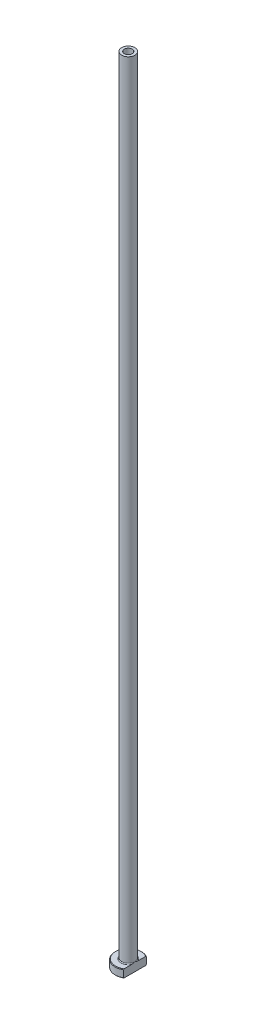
ISO-10303-21;
HEADER;
FILE_DESCRIPTION(('STEP AP214'),'2;1');
FILE_NAME('part.step','',(''),(''),'','','');
FILE_SCHEMA(('AUTOMOTIVE_DESIGN { 1 0 10303 214 1 1 1 1 }'));
ENDSEC;
DATA;
#1=APPLICATION_CONTEXT('core data for automotive mechanical design processes');
#2=APPLICATION_PROTOCOL_DEFINITION('international standard','automotive_design',2000,#1);
#3=PRODUCT_CONTEXT('',#1,'mechanical');
#4=PRODUCT('Part','Part','',(#3));
#5=PRODUCT_RELATED_PRODUCT_CATEGORY('part','',(#4));
#6=PRODUCT_DEFINITION_FORMATION('','',#4);
#7=PRODUCT_DEFINITION_CONTEXT('part definition',#1,'design');
#8=PRODUCT_DEFINITION('design','',#6,#7);
#9=PRODUCT_DEFINITION_SHAPE('','',#8);
#10=(LENGTH_UNIT() NAMED_UNIT(*) SI_UNIT(.MILLI.,.METRE.));
#11=(NAMED_UNIT(*) PLANE_ANGLE_UNIT() SI_UNIT($,.RADIAN.));
#12=(NAMED_UNIT(*) SI_UNIT($,.STERADIAN.) SOLID_ANGLE_UNIT());
#13=UNCERTAINTY_MEASURE_WITH_UNIT(LENGTH_MEASURE(1.E-05),#10,'distance_accuracy_value','');
#14=(GEOMETRIC_REPRESENTATION_CONTEXT(3) GLOBAL_UNCERTAINTY_ASSIGNED_CONTEXT((#13)) GLOBAL_UNIT_ASSIGNED_CONTEXT((#10,
#11,#12)) REPRESENTATION_CONTEXT('',''));
#15=CARTESIAN_POINT('',(0.,0.,0.));
#16=DIRECTION('',(0.,0.,1.));
#17=DIRECTION('',(1.,0.,0.));
#18=AXIS2_PLACEMENT_3D('',#15,#16,#17);
#19=CARTESIAN_POINT('',(0.,92.1876809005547,0.));
#20=DIRECTION('',(0.,1.,0.));
#21=DIRECTION('',(0.,0.,1.));
#22=AXIS2_PLACEMENT_3D('',#19,#20,#21);
#23=CYLINDRICAL_SURFACE('',#22,1.50000000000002);
#24=CARTESIAN_POINT('',(0.,300.,0.));
#25=DIRECTION('',(0.,1.,0.));
#26=DIRECTION('',(0.,0.,1.));
#27=AXIS2_PLACEMENT_3D('',#24,#25,#26);
#28=CIRCLE('',#27,1.50000000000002);
#29=CARTESIAN_POINT('',(0.,300.,1.50000000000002));
#30=VERTEX_POINT('',#29);
#31=EDGE_CURVE('E167',#30,#30,#28,.T.);
#32=ORIENTED_EDGE('',*,*,#31,.T.);
#33=EDGE_LOOP('',(#32));
#34=FACE_BOUND('',#33,.T.);
#35=CARTESIAN_POINT('',(0.,255.,0.));
#36=DIRECTION('',(0.,1.,0.));
#37=DIRECTION('',(0.,0.,1.));
#38=AXIS2_PLACEMENT_3D('',#35,#36,#37);
#39=CIRCLE('',#38,1.50000000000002);
#40=CARTESIAN_POINT('',(0.,255.,1.50000000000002));
#41=VERTEX_POINT('',#40);
#42=EDGE_CURVE('E170',#41,#41,#39,.T.);
#43=ORIENTED_EDGE('',*,*,#42,.F.);
#44=EDGE_LOOP('',(#43));
#45=FACE_BOUND('',#44,.T.);
#46=ADVANCED_FACE('F32',(#34,#45),#23,.F.);
#47=CARTESIAN_POINT('',(-1.50000000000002,300.,0.));
#48=DIRECTION('',(0.,1.,0.));
#49=DIRECTION('',(0.,0.,1.));
#50=AXIS2_PLACEMENT_3D('',#47,#48,#49);
#51=PLANE('',#50);
#52=CARTESIAN_POINT('',(0.,300.,0.));
#53=DIRECTION('',(0.,1.,0.));
#54=DIRECTION('',(0.,0.,1.));
#55=AXIS2_PLACEMENT_3D('',#52,#53,#54);
#56=CIRCLE('',#55,2.50000000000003);
#57=CARTESIAN_POINT('',(0.,300.,2.50000000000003));
#58=VERTEX_POINT('',#57);
#59=EDGE_CURVE('E174',#58,#58,#56,.T.);
#60=ORIENTED_EDGE('',*,*,#59,.T.);
#61=EDGE_LOOP('',(#60));
#62=FACE_BOUND('',#61,.T.);
#63=ORIENTED_EDGE('',*,*,#31,.F.);
#64=EDGE_LOOP('',(#63));
#65=FACE_BOUND('',#64,.T.);
#66=ADVANCED_FACE('F157',(#62,#65),#51,.T.);
#67=CARTESIAN_POINT('',(0.,92.1876809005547,0.));
#68=DIRECTION('',(0.,1.,0.));
#69=DIRECTION('',(0.,0.,1.));
#70=AXIS2_PLACEMENT_3D('',#67,#68,#69);
#71=CYLINDRICAL_SURFACE('',#70,2.50000000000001);
#72=CARTESIAN_POINT('',(0.,3.3,0.));
#73=DIRECTION('',(0.,1.,0.));
#74=DIRECTION('',(0.,0.,1.));
#75=AXIS2_PLACEMENT_3D('',#72,#73,#74);
#76=CIRCLE('',#75,2.50000000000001);
#77=CARTESIAN_POINT('',(2.5,3.3,0.));
#78=VERTEX_POINT('',#77);
#79=EDGE_CURVE('E180',#78,#78,#76,.T.);
#80=ORIENTED_EDGE('',*,*,#79,.T.);
#81=EDGE_LOOP('',(#80));
#82=FACE_BOUND('',#81,.T.);
#83=ORIENTED_EDGE('',*,*,#59,.F.);
#84=EDGE_LOOP('',(#83));
#85=FACE_BOUND('',#84,.T.);
#86=ADVANCED_FACE('F162',(#82,#85),#71,.T.);
#87=CARTESIAN_POINT('',(-2.49999999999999,3.,0.));
#88=DIRECTION('',(0.,1.,0.));
#89=DIRECTION('',(0.,0.,1.));
#90=AXIS2_PLACEMENT_3D('',#87,#88,#89);
#91=PLANE('',#90);
#92=DIRECTION('',(0.,0.,1.));
#93=VECTOR('',#92,1.);
#94=CARTESIAN_POINT('',(2.49999999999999,3.,0.));
#95=LINE('',#94,#93);
#96=CARTESIAN_POINT('',(2.5,3.,-4.09756024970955));
#97=VERTEX_POINT('',#96);
#98=CARTESIAN_POINT('',(2.49999999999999,3.,-1.26095202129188));
#99=VERTEX_POINT('',#98);
#100=EDGE_CURVE('E54',#97,#99,#95,.T.);
#101=ORIENTED_EDGE('',*,*,#100,.F.);
#102=CARTESIAN_POINT('',(0.,3.,0.));
#103=DIRECTION('',(0.,1.,0.));
#104=DIRECTION('',(0.,0.,1.));
#105=AXIS2_PLACEMENT_3D('',#102,#103,#104);
#106=CIRCLE('',#105,4.79999999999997);
#107=CARTESIAN_POINT('',(2.49999999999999,3.,4.09756024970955));
#108=VERTEX_POINT('',#107);
#109=EDGE_CURVE('E186',#97,#108,#106,.T.);
#110=ORIENTED_EDGE('',*,*,#109,.T.);
#111=CARTESIAN_POINT('',(2.49999999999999,3.,1.26095202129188));
#112=VERTEX_POINT('',#111);
#113=EDGE_CURVE('E134',#112,#108,#95,.T.);
#114=ORIENTED_EDGE('',*,*,#113,.F.);
#115=CARTESIAN_POINT('',(0.,3.,0.));
#116=DIRECTION('',(0.,1.,0.));
#117=DIRECTION('',(0.,0.,1.));
#118=AXIS2_PLACEMENT_3D('',#115,#116,#117);
#119=CIRCLE('',#118,2.80000000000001);
#120=EDGE_CURVE('E183',#112,#99,#119,.F.);
#121=ORIENTED_EDGE('',*,*,#120,.T.);
#122=EDGE_LOOP('',(#101,#110,#114,#121));
#123=FACE_BOUND('',#122,.T.);
#124=ADVANCED_FACE('F197',(#123),#91,.T.);
#125=CARTESIAN_POINT('',(0.,92.1876809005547,0.));
#126=DIRECTION('',(0.,1.,0.));
#127=DIRECTION('',(0.,0.,1.));
#128=AXIS2_PLACEMENT_3D('',#125,#126,#127);
#129=CYLINDRICAL_SURFACE('',#128,4.99999999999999);
#130=DIRECTION('',(0.,-1.,0.));
#131=VECTOR('',#130,1.);
#132=CARTESIAN_POINT('',(2.49999999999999,300.,4.33012701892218));
#133=LINE('',#132,#131);
#134=CARTESIAN_POINT('',(2.49999999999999,2.79999999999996,4.33012701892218));
#135=VERTEX_POINT('',#134);
#136=CARTESIAN_POINT('',(2.49999999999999,0.199999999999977,4.33012701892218));
#137=VERTEX_POINT('',#136);
#138=EDGE_CURVE('E82',#135,#137,#133,.T.);
#139=ORIENTED_EDGE('',*,*,#138,.F.);
#140=CARTESIAN_POINT('',(0.,2.79999999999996,0.));
#141=DIRECTION('',(0.,1.,0.));
#142=DIRECTION('',(0.,0.,1.));
#143=AXIS2_PLACEMENT_3D('',#140,#141,#142);
#144=CIRCLE('',#143,4.99999999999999);
#145=CARTESIAN_POINT('',(2.5,2.79999999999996,-4.33012701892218));
#146=VERTEX_POINT('',#145);
#147=EDGE_CURVE('E95',#135,#146,#144,.F.);
#148=ORIENTED_EDGE('',*,*,#147,.T.);
#149=DIRECTION('',(0.,-1.,0.));
#150=VECTOR('',#149,1.);
#151=CARTESIAN_POINT('',(2.5,300.,-4.33012701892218));
#152=LINE('',#151,#150);
#153=CARTESIAN_POINT('',(2.5,0.199999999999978,-4.33012701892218));
#154=VERTEX_POINT('',#153);
#155=EDGE_CURVE('E192',#146,#154,#152,.T.);
#156=ORIENTED_EDGE('',*,*,#155,.T.);
#157=CARTESIAN_POINT('',(0.,0.199999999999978,0.));
#158=DIRECTION('',(0.,-1.,0.));
#159=DIRECTION('',(0.,0.,-1.));
#160=AXIS2_PLACEMENT_3D('',#157,#158,#159);
#161=CIRCLE('',#160,4.99999999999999);
#162=EDGE_CURVE('E98',#154,#137,#161,.F.);
#163=ORIENTED_EDGE('',*,*,#162,.T.);
#164=EDGE_LOOP('',(#139,#148,#156,#163));
#165=FACE_BOUND('',#164,.T.);
#166=ADVANCED_FACE('F190',(#165),#129,.T.);
#167=CARTESIAN_POINT('',(-4.99999999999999,0.,0.));
#168=DIRECTION('',(0.,-1.,0.));
#169=DIRECTION('',(0.,0.,-1.));
#170=AXIS2_PLACEMENT_3D('',#167,#168,#169);
#171=PLANE('',#170);
#172=CARTESIAN_POINT('',(0.,0.,0.));
#173=DIRECTION('',(0.,-1.,0.));
#174=DIRECTION('',(0.,0.,-1.));
#175=AXIS2_PLACEMENT_3D('',#172,#173,#174);
#176=CIRCLE('',#175,2.24999999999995);
#177=CARTESIAN_POINT('',(0.,0.,-2.24999999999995));
#178=VERTEX_POINT('',#177);
#179=EDGE_CURVE('E40',#178,#178,#176,.F.);
#180=ORIENTED_EDGE('',*,*,#179,.T.);
#181=EDGE_LOOP('',(#180));
#182=FACE_BOUND('',#181,.T.);
#183=DIRECTION('',(0.,0.,-1.));
#184=VECTOR('',#183,1.);
#185=CARTESIAN_POINT('',(2.49999999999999,0.,4.33012701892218));
#186=LINE('',#185,#184);
#187=CARTESIAN_POINT('',(2.49999999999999,0.,4.09756024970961));
#188=VERTEX_POINT('',#187);
#189=CARTESIAN_POINT('',(2.5,0.,-4.09756024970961));
#190=VERTEX_POINT('',#189);
#191=EDGE_CURVE('E47',#188,#190,#186,.T.);
#192=ORIENTED_EDGE('',*,*,#191,.F.);
#193=CARTESIAN_POINT('',(0.,0.,0.));
#194=DIRECTION('',(0.,-1.,0.));
#195=DIRECTION('',(0.,0.,-1.));
#196=AXIS2_PLACEMENT_3D('',#193,#194,#195);
#197=CIRCLE('',#196,4.80000000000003);
#198=EDGE_CURVE('E92',#188,#190,#197,.T.);
#199=ORIENTED_EDGE('',*,*,#198,.T.);
#200=EDGE_LOOP('',(#192,#199));
#201=FACE_BOUND('',#200,.T.);
#202=ADVANCED_FACE('F91',(#182,#201),#171,.T.);
#203=CARTESIAN_POINT('',(0.,92.1876809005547,0.));
#204=DIRECTION('',(0.,1.,0.));
#205=DIRECTION('',(0.,0.,1.));
#206=AXIS2_PLACEMENT_3D('',#203,#204,#205);
#207=CYLINDRICAL_SURFACE('',#206,1.75000000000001);
#208=CARTESIAN_POINT('',(0.,0.499999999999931,0.));
#209=DIRECTION('',(0.,-1.,0.));
#210=DIRECTION('',(0.,0.,-1.));
#211=AXIS2_PLACEMENT_3D('',#208,#209,#210);
#212=CIRCLE('',#211,1.75000000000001);
#213=CARTESIAN_POINT('',(0.,0.499999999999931,-1.75000000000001));
#214=VERTEX_POINT('',#213);
#215=EDGE_CURVE('E11',#214,#214,#212,.T.);
#216=ORIENTED_EDGE('',*,*,#215,.T.);
#217=EDGE_LOOP('',(#216));
#218=FACE_BOUND('',#217,.T.);
#219=CARTESIAN_POINT('',(0.,243.,0.));
#220=DIRECTION('',(0.,1.,0.));
#221=DIRECTION('',(0.,0.,1.));
#222=AXIS2_PLACEMENT_3D('',#219,#220,#221);
#223=CIRCLE('',#222,1.75000000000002);
#224=CARTESIAN_POINT('',(0.,243.,1.75000000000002));
#225=VERTEX_POINT('',#224);
#226=EDGE_CURVE('E172',#225,#225,#223,.T.);
#227=ORIENTED_EDGE('',*,*,#226,.T.);
#228=EDGE_LOOP('',(#227));
#229=FACE_BOUND('',#228,.T.);
#230=ADVANCED_FACE('F215',(#218,#229),#207,.F.);
#231=CARTESIAN_POINT('',(0.,243.,0.));
#232=DIRECTION('',(0.,-1.,0.));
#233=DIRECTION('',(0.,0.,-1.));
#234=AXIS2_PLACEMENT_3D('',#231,#232,#233);
#235=CONICAL_SURFACE('',#234,1.75000000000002,0.0208303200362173);
#236=ORIENTED_EDGE('',*,*,#42,.T.);
#237=EDGE_LOOP('',(#236));
#238=FACE_BOUND('',#237,.T.);
#239=ORIENTED_EDGE('',*,*,#226,.F.);
#240=EDGE_LOOP('',(#239));
#241=FACE_BOUND('',#240,.T.);
#242=ADVANCED_FACE('F111',(#238,#241),#235,.F.);
#243=CARTESIAN_POINT('',(0.,3.3,0.));
#244=DIRECTION('',(0.,1.,0.));
#245=DIRECTION('',(0.,0.,1.));
#246=AXIS2_PLACEMENT_3D('',#243,#244,#245);
#247=TOROIDAL_SURFACE('',#246,2.80000000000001,0.3);
#248=ORIENTED_EDGE('',*,*,#120,.F.);
#249=CARTESIAN_POINT('',(2.5,3.3,0.));
#250=CARTESIAN_POINT('',(2.5,3.30000062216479,-4.84267967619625E-11));
#251=CARTESIAN_POINT('',(2.5,3.30000124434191,1.59621122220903E-07));
#252=CARTESIAN_POINT('',(2.5,3.30000243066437,6.45478146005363E-07));
#253=CARTESIAN_POINT('',(2.5,3.30000299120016,9.78480940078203E-07));
#254=CARTESIAN_POINT('',(2.5,3.30000411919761,1.77472016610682E-06));
#255=CARTESIAN_POINT('',(2.5,3.30000467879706,2.24902187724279E-06));
#256=CARTESIAN_POINT('',(2.5,3.30000572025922,3.25953733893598E-06));
#257=CARTESIAN_POINT('',(2.5,3.30000620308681,3.79480797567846E-06));
#258=CARTESIAN_POINT('',(2.5,3.30000787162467,5.7579472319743E-06));
#259=CARTESIAN_POINT('',(2.5,3.30000896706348,7.26424237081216E-06));
#260=CARTESIAN_POINT('',(2.5,3.30001087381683,1.03361145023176E-05));
#261=CARTESIAN_POINT('',(2.5,3.30001169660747,1.18949514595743E-05));
#262=CARTESIAN_POINT('',(2.5,3.30001489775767,1.81400878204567E-05));
#263=CARTESIAN_POINT('',(2.5,3.30001712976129,2.29062213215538E-05));
#264=CARTESIAN_POINT('',(2.5,3.30002067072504,3.2179390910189E-05));
#265=CARTESIAN_POINT('',(2.5,3.30002205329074,3.66589029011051E-05));
#266=CARTESIAN_POINT('',(2.5,3.30002810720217,5.61718468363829E-05));
#267=CARTESIAN_POINT('',(2.5,3.30003284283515,7.11735952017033E-05));
#268=CARTESIAN_POINT('',(2.5,3.30004025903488,9.89920432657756E-05));
#269=CARTESIAN_POINT('',(2.5,3.30004315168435,0.000111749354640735));
#270=CARTESIAN_POINT('',(2.49999999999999,3.30006652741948,0.000206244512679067));
#271=CARTESIAN_POINT('',(2.49999999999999,3.30009698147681,0.000285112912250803));
#272=CARTESIAN_POINT('',(2.5,3.30021213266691,0.000594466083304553));
#273=CARTESIAN_POINT('',(2.5,3.30028938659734,0.000826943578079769));
#274=CARTESIAN_POINT('',(2.49999999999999,3.30059681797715,0.00173885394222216));
#275=CARTESIAN_POINT('',(2.49999999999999,3.30083479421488,0.00241625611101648));
#276=CARTESIAN_POINT('',(2.5,3.30181198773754,0.0052106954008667));
#277=CARTESIAN_POINT('',(2.5,3.30254240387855,0.00732996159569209));
#278=CARTESIAN_POINT('',(2.49999999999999,3.31226043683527,0.0355096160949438));
#279=CARTESIAN_POINT('',(2.49999999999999,3.32130808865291,0.0615551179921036));
#280=CARTESIAN_POINT('',(2.5,3.33896212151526,0.11267798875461));
#281=CARTESIAN_POINT('',(2.5,3.34757212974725,0.137754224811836));
#282=CARTESIAN_POINT('',(2.49999999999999,3.36573068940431,0.190981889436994));
#283=CARTESIAN_POINT('',(2.5,3.37526654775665,0.219137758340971));
#284=CARTESIAN_POINT('',(2.5,3.39422867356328,0.275816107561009));
#285=CARTESIAN_POINT('',(2.5,3.40365272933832,0.304339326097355));
#286=CARTESIAN_POINT('',(2.5,3.42641697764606,0.374416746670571));
#287=CARTESIAN_POINT('',(2.5,3.43959811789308,0.416023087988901));
#288=CARTESIAN_POINT('',(2.5,3.46479157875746,0.498481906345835));
#289=CARTESIAN_POINT('',(2.5,3.47682455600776,0.539328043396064));
#290=CARTESIAN_POINT('',(2.5,3.50224427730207,0.629981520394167));
#291=CARTESIAN_POINT('',(2.5,3.51538048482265,0.679860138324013));
#292=CARTESIAN_POINT('',(2.5,3.53964074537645,0.780511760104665));
#293=CARTESIAN_POINT('',(2.5,3.55074877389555,0.831288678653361));
#294=CARTESIAN_POINT('',(2.5,3.57087054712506,0.9370634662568));
#295=CARTESIAN_POINT('',(2.5,3.57967623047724,0.992102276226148));
#296=CARTESIAN_POINT('',(2.5,3.59301148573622,1.1025602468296));
#297=CARTESIAN_POINT('',(2.5,3.59755297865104,1.15797790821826));
#298=CARTESIAN_POINT('',(2.5,3.60093314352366,1.2678670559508));
#299=CARTESIAN_POINT('',(2.5,3.59989366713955,1.32233291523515));
#300=CARTESIAN_POINT('',(2.5,3.59277279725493,1.40310062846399));
#301=CARTESIAN_POINT('',(2.5,3.58952137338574,1.42965222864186));
#302=CARTESIAN_POINT('',(2.5,3.58085857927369,1.48239078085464));
#303=CARTESIAN_POINT('',(2.5,3.57544928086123,1.50857805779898));
#304=CARTESIAN_POINT('',(2.5,3.56298810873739,1.55658799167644));
#305=CARTESIAN_POINT('',(2.5,3.55628200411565,1.57849902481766));
#306=CARTESIAN_POINT('',(2.5,3.54055393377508,1.62160292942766));
#307=CARTESIAN_POINT('',(2.5,3.5315222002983,1.64279233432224));
#308=CARTESIAN_POINT('',(2.5,3.51057199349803,1.68404469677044));
#309=CARTESIAN_POINT('',(2.5,3.49862012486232,1.70409105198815));
#310=CARTESIAN_POINT('',(2.5,3.47134074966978,1.74172093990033));
#311=CARTESIAN_POINT('',(2.5,3.45603127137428,1.75931683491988));
#312=CARTESIAN_POINT('',(2.5,3.42979930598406,1.78297070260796));
#313=CARTESIAN_POINT('',(2.5,3.42024268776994,1.79054141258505));
#314=CARTESIAN_POINT('',(2.5,3.40009035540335,1.80416997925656));
#315=CARTESIAN_POINT('',(2.5,3.38949499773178,1.81022835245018));
#316=CARTESIAN_POINT('',(2.5,3.36727740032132,1.82047087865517));
#317=CARTESIAN_POINT('',(2.5,3.35564531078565,1.82463409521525));
#318=CARTESIAN_POINT('',(2.5,3.33178837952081,1.83058442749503));
#319=CARTESIAN_POINT('',(2.5,3.31956435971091,1.83237474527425));
#320=CARTESIAN_POINT('',(2.5,3.29665736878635,1.83331852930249));
#321=CARTESIAN_POINT('',(2.5,3.285986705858,1.83279233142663));
#322=CARTESIAN_POINT('',(2.5,3.26490749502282,1.82986307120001));
#323=CARTESIAN_POINT('',(2.5,3.25449899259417,1.82745968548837));
#324=CARTESIAN_POINT('',(2.5,3.23467098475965,1.82111257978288));
#325=CARTESIAN_POINT('',(2.5,3.2252281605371,1.8172402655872));
#326=CARTESIAN_POINT('',(2.5,3.20699535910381,1.80819497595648));
#327=CARTESIAN_POINT('',(2.5,3.1982055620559,1.80302164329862));
#328=CARTESIAN_POINT('',(2.5,3.17663162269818,1.78842115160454));
#329=CARTESIAN_POINT('',(2.5,3.16436228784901,1.77823293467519));
#330=CARTESIAN_POINT('',(2.5,3.14157828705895,1.75604629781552));
#331=CARTESIAN_POINT('',(2.5,3.13106906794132,1.7440424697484));
#332=CARTESIAN_POINT('',(2.5,3.10600520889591,1.71142114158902));
#333=CARTESIAN_POINT('',(2.5,3.09267476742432,1.6898688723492));
#334=CARTESIAN_POINT('',(2.5,3.06940323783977,1.64508572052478));
#335=CARTESIAN_POINT('',(2.5,3.05946314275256,1.62185434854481));
#336=CARTESIAN_POINT('',(2.5,3.03545750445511,1.55546754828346));
#337=CARTESIAN_POINT('',(2.5,3.0244402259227,1.51122187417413));
#338=CARTESIAN_POINT('',(2.5,3.00863926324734,1.42119777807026));
#339=CARTESIAN_POINT('',(2.5,3.00393876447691,1.37540689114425));
#340=CARTESIAN_POINT('',(2.5,2.9992421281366,1.28072198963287));
#341=CARTESIAN_POINT('',(2.5,2.99956098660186,1.23181420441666));
#342=CARTESIAN_POINT('',(2.5,3.00436098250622,1.1341094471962));
#343=CARTESIAN_POINT('',(2.5,3.00885327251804,1.08531312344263));
#344=CARTESIAN_POINT('',(2.5,3.02074191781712,0.990773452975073));
#345=CARTESIAN_POINT('',(2.5,3.02796792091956,0.945007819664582));
#346=CARTESIAN_POINT('',(2.5,3.04465555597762,0.854199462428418));
#347=CARTESIAN_POINT('',(2.5,3.05410250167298,0.809153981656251));
#348=CARTESIAN_POINT('',(2.5,3.07710029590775,0.709411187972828));
#349=CARTESIAN_POINT('',(2.5,3.0910963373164,0.654817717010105));
#350=CARTESIAN_POINT('',(2.5,3.12140740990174,0.544863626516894));
#351=CARTESIAN_POINT('',(2.49999999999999,3.13777040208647,0.48951645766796));
#352=CARTESIAN_POINT('',(2.5,3.16649540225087,0.396740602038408));
#353=CARTESIAN_POINT('',(2.5,3.17848130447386,0.35919385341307));
#354=CARTESIAN_POINT('',(2.49999999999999,3.20280507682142,0.284651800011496));
#355=CARTESIAN_POINT('',(2.49999999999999,3.21513791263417,0.247654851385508));
#356=CARTESIAN_POINT('',(2.5,3.23873713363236,0.17776725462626));
#357=CARTESIAN_POINT('',(2.5,3.24997409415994,0.144866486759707));
#358=CARTESIAN_POINT('',(2.49999999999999,3.27307149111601,0.0777985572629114));
#359=CARTESIAN_POINT('',(2.49999999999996,3.28493883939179,0.0436336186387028));
#360=CARTESIAN_POINT('',(2.5,3.29745794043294,0.00732879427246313));
#361=CARTESIAN_POINT('',(2.5,3.29818879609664,0.00520838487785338));
#362=CARTESIAN_POINT('',(2.49999999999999,3.29916610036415,0.00241367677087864));
#363=CARTESIAN_POINT('',(2.49999999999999,3.2994037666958,0.00173715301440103));
#364=CARTESIAN_POINT('',(2.5,3.29971082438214,0.000826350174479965));
#365=CARTESIAN_POINT('',(2.5,3.29978800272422,0.000594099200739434));
#366=CARTESIAN_POINT('',(2.49999999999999,3.29990305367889,0.000285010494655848));
#367=CARTESIAN_POINT('',(2.49999999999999,3.29993349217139,0.000206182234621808));
#368=CARTESIAN_POINT('',(2.5,3.2999568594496,0.000111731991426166));
#369=CARTESIAN_POINT('',(2.5,3.29995975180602,9.89774423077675E-05));
#370=CARTESIAN_POINT('',(2.5,3.29996716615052,7.11651965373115E-05));
#371=CARTESIAN_POINT('',(2.5,3.29997189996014,5.61668155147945E-05));
#372=CARTESIAN_POINT('',(2.5,3.29997795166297,3.66576364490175E-05));
#373=CARTESIAN_POINT('',(2.5,3.29997933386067,3.21785282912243E-05));
#374=CARTESIAN_POINT('',(2.5,3.29998287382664,2.29061406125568E-05));
#375=CARTESIAN_POINT('',(2.5,3.29998510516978,1.81403684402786E-05));
#376=CARTESIAN_POINT('',(2.5,3.29998830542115,1.18955835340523E-05));
#377=CARTESIAN_POINT('',(2.5,3.29998912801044,1.03367775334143E-05));
#378=CARTESIAN_POINT('',(2.5,3.29999103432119,7.26492892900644E-06));
#379=CARTESIAN_POINT('',(2.5,3.2999921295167,5.75862363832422E-06));
#380=CARTESIAN_POINT('',(2.5,3.29999379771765,3.79542513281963E-06));
#381=CARTESIAN_POINT('',(2.5,3.2999942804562,3.26012805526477E-06));
#382=CARTESIAN_POINT('',(2.5,3.29999532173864,2.2495436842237E-06));
#383=CARTESIAN_POINT('',(2.5,3.29999588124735,1.77519922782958E-06));
#384=CARTESIAN_POINT('',(2.5,3.29999700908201,9.78857276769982E-07));
#385=CARTESIAN_POINT('',(2.5,3.2999975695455,6.45797195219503E-07));
#386=CARTESIAN_POINT('',(2.5,3.29999875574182,1.59799659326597E-07));
#387=CARTESIAN_POINT('',(2.5,3.29999937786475,4.84249982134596E-11));
#388=CARTESIAN_POINT('',(2.5,3.3,0.));
#389=B_SPLINE_CURVE_WITH_KNOTS('',3,(#249,#250,#251,#252,#253,#254,#255,#256,#257,#258,#259,
#260,#261,#262,#263,#264,#265,#266,#267,#268,#269,#270,#271,#272,#273,#274,#275,#276,#277,#278,
#279,#280,#281,#282,#283,#284,#285,#286,#287,#288,#289,#290,#291,#292,#293,#294,#295,#296,#297,
#298,#299,#300,#301,#302,#303,#304,#305,#306,#307,#308,#309,#310,#311,#312,#313,#314,#315,#316,
#317,#318,#319,#320,#321,#322,#323,#324,#325,#326,#327,#328,#329,#330,#331,#332,#333,#334,#335,
#336,#337,#338,#339,#340,#341,#342,#343,#344,#345,#346,#347,#348,#349,#350,#351,#352,#353,#354,
#355,#356,#357,#358,#359,#360,#361,#362,#363,#364,#365,#366,#367,#368,#369,#370,#371,#372,#373,
#374,#375,#376,#377,#378,#379,#380,#381,#382,#383,#384,#385,#386,#387,#388),.UNSPECIFIED.,.T.,
.F.,(4,2,2,2,2,2,2,2,2,2,2,2,2,2,2,2,2,2,2,2,2,2,2,2,2,2,2,2,2,2,2,2,2,2,2,2,2,2,2,2,2,2,2,2,2,
2,2,2,2,2,2,2,2,2,2,2,2,2,2,2,2,2,2,2,2,2,2,2,2,4),(0.,1.86789089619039E-06,3.8154934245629E-06,
6.00610108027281E-06,8.16652503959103E-06,1.37285534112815E-05,1.90122100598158E-05,
3.47597220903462E-05,4.88082530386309E-05,9.59978388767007E-05,0.000135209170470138,
0.000388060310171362,0.00112364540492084,0.00327678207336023,0.0100024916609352,
0.092712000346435,0.172253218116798,0.261432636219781,0.351551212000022,0.482477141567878,
0.610212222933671,0.764915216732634,0.920792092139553,1.08787897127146,1.25449733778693,
1.41749285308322,1.49767530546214,1.57778095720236,1.64642481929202,1.71536183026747,
1.78512750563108,1.8545273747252,1.89099315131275,1.92744645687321,1.96429324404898,
2.00109025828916,2.03297105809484,2.06485735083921,2.09535926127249,2.12586955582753,
2.173440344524,2.22115572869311,2.29675134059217,2.37236907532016,2.50839721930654,
2.64619971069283,2.79268284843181,2.93955855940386,3.07848421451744,3.21651583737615,
3.38554045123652,3.55865938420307,3.67689643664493,3.79388863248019,3.89819085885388,
4.0066832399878,4.01341261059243,4.01556295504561,4.01629782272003,4.01655054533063,
4.01658974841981,4.01663692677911,4.01665097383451,4.01666671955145,4.01667200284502,
4.01667756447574,4.01667972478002,4.01668191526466,4.01668386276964,4.01668573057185),.UNSPECIFIED.);
#390=EDGE_CURVE('E126',#112,#78,#389,.T.);
#391=ORIENTED_EDGE('',*,*,#390,.T.);
#392=ORIENTED_EDGE('',*,*,#79,.F.);
#393=CARTESIAN_POINT('',(2.5,3.3,0.));
#394=CARTESIAN_POINT('',(2.5,3.29999937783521,4.84273172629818E-11));
#395=CARTESIAN_POINT('',(2.5,3.29999875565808,-1.59621121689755E-07));
#396=CARTESIAN_POINT('',(2.5,3.29999756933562,-6.45478145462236E-07));
#397=CARTESIAN_POINT('',(2.5,3.29999700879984,-9.78480939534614E-07));
#398=CARTESIAN_POINT('',(2.5,3.29999588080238,-1.77472016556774E-06));
#399=CARTESIAN_POINT('',(2.5,3.29999532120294,-2.24902187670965E-06));
#400=CARTESIAN_POINT('',(2.5,3.29999427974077,-3.25953733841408E-06));
#401=CARTESIAN_POINT('',(2.5,3.29999379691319,-3.79480797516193E-06));
#402=CARTESIAN_POINT('',(2.5,3.29999212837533,-5.75794723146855E-06));
#403=CARTESIAN_POINT('',(2.5,3.29999103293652,-7.26424237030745E-06));
#404=CARTESIAN_POINT('',(2.5,3.29998912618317,-1.03361145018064E-05));
#405=CARTESIAN_POINT('',(2.5,3.29998830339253,-1.18949514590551E-05));
#406=CARTESIAN_POINT('',(2.5,3.29998510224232,-1.81400878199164E-05));
#407=CARTESIAN_POINT('',(2.5,3.2999828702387,-2.29062213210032E-05));
#408=CARTESIAN_POINT('',(2.5,3.29997932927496,-3.21793909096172E-05));
#409=CARTESIAN_POINT('',(2.5,3.29997794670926,-3.66589029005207E-05));
#410=CARTESIAN_POINT('',(2.5,3.29997189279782,-5.61718468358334E-05));
#411=CARTESIAN_POINT('',(2.5,3.29996715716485,-7.11735952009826E-05));
#412=CARTESIAN_POINT('',(2.5,3.29995974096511,-9.89920432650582E-05));
#413=CARTESIAN_POINT('',(2.5,3.29995684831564,-0.000111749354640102));
#414=CARTESIAN_POINT('',(2.49999999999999,3.29993347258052,-0.000206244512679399));
#415=CARTESIAN_POINT('',(2.49999999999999,3.29990301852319,-0.00028511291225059));
#416=CARTESIAN_POINT('',(2.5,3.29978786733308,-0.000594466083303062));
#417=CARTESIAN_POINT('',(2.5,3.29971061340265,-0.000826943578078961));
#418=CARTESIAN_POINT('',(2.49999999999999,3.29940318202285,-0.00173885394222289));
#419=CARTESIAN_POINT('',(2.49999999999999,3.29916520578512,-0.00241625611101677));
#420=CARTESIAN_POINT('',(2.5,3.29818801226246,-0.00521069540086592));
#421=CARTESIAN_POINT('',(2.5,3.29745759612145,-0.00732996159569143));
#422=CARTESIAN_POINT('',(2.49999999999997,3.28773956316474,-0.0355096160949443));
#423=CARTESIAN_POINT('',(2.49999999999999,3.27869191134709,-0.0615551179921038));
#424=CARTESIAN_POINT('',(2.5,3.26103787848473,-0.11267798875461));
#425=CARTESIAN_POINT('',(2.5,3.25242787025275,-0.137754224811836));
#426=CARTESIAN_POINT('',(2.49999999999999,3.23426931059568,-0.190981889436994));
#427=CARTESIAN_POINT('',(2.49999999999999,3.22473345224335,-0.219137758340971));
#428=CARTESIAN_POINT('',(2.5,3.20577132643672,-0.275816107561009));
#429=CARTESIAN_POINT('',(2.5,3.19634727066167,-0.304339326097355));
#430=CARTESIAN_POINT('',(2.49999999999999,3.17358302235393,-0.374416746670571));
#431=CARTESIAN_POINT('',(2.5,3.16040188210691,-0.416023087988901));
#432=CARTESIAN_POINT('',(2.5,3.13520842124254,-0.498481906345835));
#433=CARTESIAN_POINT('',(2.5,3.12317544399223,-0.539328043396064));
#434=CARTESIAN_POINT('',(2.5,3.09775572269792,-0.629981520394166));
#435=CARTESIAN_POINT('',(2.5,3.08461951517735,-0.679860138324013));
#436=CARTESIAN_POINT('',(2.5,3.06035925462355,-0.780511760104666));
#437=CARTESIAN_POINT('',(2.5,3.04925122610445,-0.831288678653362));
#438=CARTESIAN_POINT('',(2.5,3.02912945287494,-0.937063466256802));
#439=CARTESIAN_POINT('',(2.5,3.02032376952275,-0.992102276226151));
#440=CARTESIAN_POINT('',(2.5,3.00698851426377,-1.1025602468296));
#441=CARTESIAN_POINT('',(2.5,3.00244702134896,-1.15797790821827));
#442=CARTESIAN_POINT('',(2.5,2.99906685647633,-1.2678670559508));
#443=CARTESIAN_POINT('',(2.5,3.00010633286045,-1.32233291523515));
#444=CARTESIAN_POINT('',(2.5,3.00722720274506,-1.403100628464));
#445=CARTESIAN_POINT('',(2.5,3.01047862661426,-1.42965222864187));
#446=CARTESIAN_POINT('',(2.5,3.0191414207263,-1.48239078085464));
#447=CARTESIAN_POINT('',(2.5,3.02455071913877,-1.50857805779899));
#448=CARTESIAN_POINT('',(2.5,3.03701189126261,-1.55658799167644));
#449=CARTESIAN_POINT('',(2.5,3.04371799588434,-1.57849902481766));
#450=CARTESIAN_POINT('',(2.5,3.05944606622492,-1.62160292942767));
#451=CARTESIAN_POINT('',(2.5,3.0684777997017,-1.64279233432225));
#452=CARTESIAN_POINT('',(2.5,3.08942800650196,-1.68404469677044));
#453=CARTESIAN_POINT('',(2.5,3.10137987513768,-1.70409105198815));
#454=CARTESIAN_POINT('',(2.5,3.12865925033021,-1.74172093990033));
#455=CARTESIAN_POINT('',(2.5,3.14396872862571,-1.75931683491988));
#456=CARTESIAN_POINT('',(2.5,3.17020069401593,-1.78297070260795));
#457=CARTESIAN_POINT('',(2.5,3.17975731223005,-1.79054141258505));
#458=CARTESIAN_POINT('',(2.5,3.19990964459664,-1.80416997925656));
#459=CARTESIAN_POINT('',(2.5,3.21050500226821,-1.81022835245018));
#460=CARTESIAN_POINT('',(2.5,3.23272259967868,-1.82047087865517));
#461=CARTESIAN_POINT('',(2.5,3.24435468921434,-1.82463409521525));
#462=CARTESIAN_POINT('',(2.5,3.26821162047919,-1.83058442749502));
#463=CARTESIAN_POINT('',(2.5,3.28043564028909,-1.83237474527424));
#464=CARTESIAN_POINT('',(2.5,3.30334263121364,-1.83331852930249));
#465=CARTESIAN_POINT('',(2.5,3.31401329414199,-1.83279233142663));
#466=CARTESIAN_POINT('',(2.5,3.33509250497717,-1.82986307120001));
#467=CARTESIAN_POINT('',(2.5,3.34550100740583,-1.82745968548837));
#468=CARTESIAN_POINT('',(2.5,3.36532901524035,-1.82111257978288));
#469=CARTESIAN_POINT('',(2.5,3.3747718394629,-1.8172402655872));
#470=CARTESIAN_POINT('',(2.5,3.39300464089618,-1.80819497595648));
#471=CARTESIAN_POINT('',(2.5,3.40179443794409,-1.80302164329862));
#472=CARTESIAN_POINT('',(2.5,3.42336837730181,-1.78842115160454));
#473=CARTESIAN_POINT('',(2.5,3.43563771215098,-1.77823293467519));
#474=CARTESIAN_POINT('',(2.5,3.45842171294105,-1.75604629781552));
#475=CARTESIAN_POINT('',(2.5,3.46893093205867,-1.7440424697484));
#476=CARTESIAN_POINT('',(2.5,3.49399479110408,-1.71142114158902));
#477=CARTESIAN_POINT('',(2.5,3.50732523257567,-1.6898688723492));
#478=CARTESIAN_POINT('',(2.5,3.53059676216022,-1.64508572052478));
#479=CARTESIAN_POINT('',(2.5,3.54053685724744,-1.62185434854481));
#480=CARTESIAN_POINT('',(2.5,3.56454249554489,-1.55546754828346));
#481=CARTESIAN_POINT('',(2.5,3.5755597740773,-1.51122187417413));
#482=CARTESIAN_POINT('',(2.5,3.59136073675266,-1.42119777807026));
#483=CARTESIAN_POINT('',(2.5,3.59606123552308,-1.37540689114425));
#484=CARTESIAN_POINT('',(2.5,3.60075787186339,-1.28072198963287));
#485=CARTESIAN_POINT('',(2.5,3.60043901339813,-1.23181420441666));
#486=CARTESIAN_POINT('',(2.5,3.59563901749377,-1.1341094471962));
#487=CARTESIAN_POINT('',(2.5,3.59114672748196,-1.08531312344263));
#488=CARTESIAN_POINT('',(2.5,3.57925808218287,-0.990773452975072));
#489=CARTESIAN_POINT('',(2.5,3.57203207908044,-0.945007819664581));
#490=CARTESIAN_POINT('',(2.5,3.55534444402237,-0.854199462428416));
#491=CARTESIAN_POINT('',(2.5,3.54589749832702,-0.809153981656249));
#492=CARTESIAN_POINT('',(2.5,3.52289970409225,-0.709411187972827));
#493=CARTESIAN_POINT('',(2.5,3.50890366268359,-0.654817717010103));
#494=CARTESIAN_POINT('',(2.5,3.47859259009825,-0.544863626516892));
#495=CARTESIAN_POINT('',(2.49999999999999,3.46222959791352,-0.489516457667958));
#496=CARTESIAN_POINT('',(2.5,3.43350459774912,-0.396740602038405));
#497=CARTESIAN_POINT('',(2.5,3.42151869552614,-0.359193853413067));
#498=CARTESIAN_POINT('',(2.49999999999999,3.39719492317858,-0.284651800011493));
#499=CARTESIAN_POINT('',(2.49999999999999,3.38486208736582,-0.247654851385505));
#500=CARTESIAN_POINT('',(2.5,3.36126286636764,-0.177767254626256));
#501=CARTESIAN_POINT('',(2.50000000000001,3.35002590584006,-0.144866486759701));
#502=CARTESIAN_POINT('',(2.49999999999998,3.32692850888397,-0.0777985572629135));
#503=CARTESIAN_POINT('',(2.49999999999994,3.31506116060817,-0.0436336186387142));
#504=CARTESIAN_POINT('',(2.5,3.30254205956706,-0.00732879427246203));
#505=CARTESIAN_POINT('',(2.5,3.30181120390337,-0.00520838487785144));
#506=CARTESIAN_POINT('',(2.49999999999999,3.30083389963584,-0.00241367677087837));
#507=CARTESIAN_POINT('',(2.49999999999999,3.30059623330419,-0.00173715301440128));
#508=CARTESIAN_POINT('',(2.5,3.30028917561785,-0.000826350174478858));
#509=CARTESIAN_POINT('',(2.5,3.30021199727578,-0.000594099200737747));
#510=CARTESIAN_POINT('',(2.49999999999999,3.30009694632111,-0.000285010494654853));
#511=CARTESIAN_POINT('',(2.49999999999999,3.3000665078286,-0.000206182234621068));
#512=CARTESIAN_POINT('',(2.5,3.30004314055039,-0.000111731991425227));
#513=CARTESIAN_POINT('',(2.5,3.30004024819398,-9.89774423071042E-05));
#514=CARTESIAN_POINT('',(2.5,3.30003283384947,-7.11651965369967E-05));
#515=CARTESIAN_POINT('',(2.5,3.30002810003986,-5.61668155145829E-05));
#516=CARTESIAN_POINT('',(2.5,3.30002204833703,-3.66576364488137E-05));
#517=CARTESIAN_POINT('',(2.5,3.30002066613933,-3.21785282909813E-05));
#518=CARTESIAN_POINT('',(2.5,3.30001712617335,-2.29061406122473E-05));
#519=CARTESIAN_POINT('',(2.5,3.30001489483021,-1.81403684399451E-05));
#520=CARTESIAN_POINT('',(2.5,3.30001169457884,-1.18955835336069E-05));
#521=CARTESIAN_POINT('',(2.5,3.30001087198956,-1.03367775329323E-05));
#522=CARTESIAN_POINT('',(2.5,3.30000896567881,-7.26492892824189E-06));
#523=CARTESIAN_POINT('',(2.5,3.3000078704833,-5.75862363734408E-06));
#524=CARTESIAN_POINT('',(2.5,3.30000620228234,-3.79542513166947E-06));
#525=CARTESIAN_POINT('',(2.5,3.3000057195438,-3.26012805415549E-06));
#526=CARTESIAN_POINT('',(2.5,3.30000467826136,-2.24954368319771E-06));
#527=CARTESIAN_POINT('',(2.5,3.30000411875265,-1.7751992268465E-06));
#528=CARTESIAN_POINT('',(2.5,3.30000299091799,-9.78857275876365E-07));
#529=CARTESIAN_POINT('',(2.5,3.30000243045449,-6.45797194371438E-07));
#530=CARTESIAN_POINT('',(2.5,3.30000124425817,-1.59799658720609E-07));
#531=CARTESIAN_POINT('',(2.5,3.30000062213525,-4.84245171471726E-11));
#532=CARTESIAN_POINT('',(2.5,3.3,0.));
#533=B_SPLINE_CURVE_WITH_KNOTS('',3,(#393,#394,#395,#396,#397,#398,#399,#400,#401,#402,#403,
#404,#405,#406,#407,#408,#409,#410,#411,#412,#413,#414,#415,#416,#417,#418,#419,#420,#421,#422,
#423,#424,#425,#426,#427,#428,#429,#430,#431,#432,#433,#434,#435,#436,#437,#438,#439,#440,#441,
#442,#443,#444,#445,#446,#447,#448,#449,#450,#451,#452,#453,#454,#455,#456,#457,#458,#459,#460,
#461,#462,#463,#464,#465,#466,#467,#468,#469,#470,#471,#472,#473,#474,#475,#476,#477,#478,#479,
#480,#481,#482,#483,#484,#485,#486,#487,#488,#489,#490,#491,#492,#493,#494,#495,#496,#497,#498,
#499,#500,#501,#502,#503,#504,#505,#506,#507,#508,#509,#510,#511,#512,#513,#514,#515,#516,#517,
#518,#519,#520,#521,#522,#523,#524,#525,#526,#527,#528,#529,#530,#531,#532),.UNSPECIFIED.,.T.,
.F.,(4,2,2,2,2,2,2,2,2,2,2,2,2,2,2,2,2,2,2,2,2,2,2,2,2,2,2,2,2,2,2,2,2,2,2,2,2,2,2,2,2,2,2,2,2,
2,2,2,2,2,2,2,2,2,2,2,2,2,2,2,2,2,2,2,2,2,2,2,2,4),(0.,1.86789089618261E-06,
3.81549342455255E-06,6.00610108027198E-06,8.1665250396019E-06,1.37285534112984E-05,
1.90122100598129E-05,3.47597220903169E-05,4.88082530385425E-05,9.59978388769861E-05,
0.000135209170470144,0.00038806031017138,0.00112364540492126,0.00327678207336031,
0.0100024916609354,0.0927120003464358,0.172253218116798,0.261432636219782,0.351551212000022,
0.482477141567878,0.610212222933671,0.764915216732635,0.920792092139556,1.08787897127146,
1.25449733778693,1.41749285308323,1.49767530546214,1.57778095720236,1.64642481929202,
1.71536183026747,1.78512750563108,1.8545273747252,1.89099315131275,1.92744645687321,
1.96429324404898,2.00109025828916,2.03297105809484,2.06485735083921,2.09535926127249,
2.12586955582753,2.173440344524,2.22115572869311,2.29675134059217,2.37236907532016,
2.50839721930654,2.64619971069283,2.79268284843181,2.93955855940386,3.07848421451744,
3.21651583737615,3.38554045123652,3.55865938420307,3.67689643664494,3.79388863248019,
3.89819085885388,4.0066832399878,4.01341261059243,4.01556295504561,4.01629782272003,
4.01655054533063,4.01658974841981,4.0166369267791,4.01665097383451,4.01666671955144,
4.01667200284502,4.01667756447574,4.01667972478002,4.01668191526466,4.01668386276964,
4.01668573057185),.UNSPECIFIED.);
#534=EDGE_CURVE('E135',#78,#99,#533,.T.);
#535=ORIENTED_EDGE('',*,*,#534,.T.);
#536=EDGE_LOOP('',(#248,#391,#392,#535));
#537=FACE_BOUND('',#536,.T.);
#538=ADVANCED_FACE('F141',(#537),#247,.F.);
#539=CARTESIAN_POINT('',(0.,3.,0.));
#540=DIRECTION('',(0.,-1.,0.));
#541=DIRECTION('',(0.,0.,-1.));
#542=AXIS2_PLACEMENT_3D('',#539,#540,#541);
#543=CONICAL_SURFACE('',#542,4.79999999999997,0.785398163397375);
#544=CARTESIAN_POINT('',(2.5,-2.05039133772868,-9.52786489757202));
#545=CARTESIAN_POINT('',(2.5,-1.84160367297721,-9.3119973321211));
#546=CARTESIAN_POINT('',(2.5,-1.63304008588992,-9.09591231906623));
#547=CARTESIAN_POINT('',(2.5,-1.21649358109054,-8.66317810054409));
#548=CARTESIAN_POINT('',(2.5,-1.00851067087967,-8.44652888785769));
#549=CARTESIAN_POINT('',(2.5,-0.593157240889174,-8.01243155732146));
#550=CARTESIAN_POINT('',(2.5,-0.385787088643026,-7.79498308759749));
#551=CARTESIAN_POINT('',(2.5,0.0280365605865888,-7.35921771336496));
#552=CARTESIAN_POINT('',(2.5,0.23449006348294,-7.14090081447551));
#553=CARTESIAN_POINT('',(2.5,0.642130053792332,-6.7074896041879));
#554=CARTESIAN_POINT('',(2.5,0.843339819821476,-6.4924172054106));
#555=CARTESIAN_POINT('',(2.5,1.24425381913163,-6.06087422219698));
#556=CARTESIAN_POINT('',(2.5,1.44395806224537,-5.84440364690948));
#557=CARTESIAN_POINT('',(2.5,1.8412775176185,-5.40963663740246));
#558=CARTESIAN_POINT('',(2.5,2.03889317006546,-5.19134060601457));
#559=CARTESIAN_POINT('',(2.5,2.43125043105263,-4.75218509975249));
#560=CARTESIAN_POINT('',(2.5,2.62599215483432,-4.53132572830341));
#561=CARTESIAN_POINT('',(2.5,2.93693788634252,-4.17181619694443));
#562=CARTESIAN_POINT('',(2.5,3.05446493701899,-4.03431188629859));
#563=CARTESIAN_POINT('',(2.5,3.28742704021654,-3.75751486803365));
#564=CARTESIAN_POINT('',(2.5,3.40286188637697,-3.61822198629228));
#565=CARTESIAN_POINT('',(2.5,3.63213234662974,-3.33586492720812));
#566=CARTESIAN_POINT('',(2.5,3.745938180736,-3.19277645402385));
#567=CARTESIAN_POINT('',(2.5,3.96956266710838,-2.90356071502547));
#568=CARTESIAN_POINT('',(2.5,4.07938227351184,-2.75743418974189));
#569=CARTESIAN_POINT('',(2.5,4.29502410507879,-2.45881038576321));
#570=CARTESIAN_POINT('',(2.5,4.40076032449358,-2.30625006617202));
#571=CARTESIAN_POINT('',(2.5,4.55286945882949,-2.07299325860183));
#572=CARTESIAN_POINT('',(2.5,4.60252613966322,-1.9944419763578));
#573=CARTESIAN_POINT('',(2.5,4.69908164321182,-1.83566827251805));
#574=CARTESIAN_POINT('',(2.5,4.74598077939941,-1.75544604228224));
#575=CARTESIAN_POINT('',(2.5,4.83578466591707,-1.59405362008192));
#576=CARTESIAN_POINT('',(2.5,4.87873126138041,-1.51290702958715));
#577=CARTESIAN_POINT('',(2.5,4.96038600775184,-1.34852090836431));
#578=CARTESIAN_POINT('',(2.5,4.99909338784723,-1.26528100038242));
#579=CARTESIAN_POINT('',(2.5,5.10703093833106,-1.01251774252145));
#580=CARTESIAN_POINT('',(2.5,5.16843307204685,-0.839342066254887));
#581=CARTESIAN_POINT('',(2.5,5.23490554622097,-0.579703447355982));
#582=CARTESIAN_POINT('',(2.5,5.25253806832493,-0.496421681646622));
#583=CARTESIAN_POINT('',(2.5,5.27986337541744,-0.32853597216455));
#584=CARTESIAN_POINT('',(2.5,5.28955686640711,-0.243932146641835));
#585=CARTESIAN_POINT('',(2.5,5.30031768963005,-0.0744340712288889));
#586=CARTESIAN_POINT('',(2.5,5.30141176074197,0.0104584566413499));
#587=CARTESIAN_POINT('',(2.5,5.29496530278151,0.179916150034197));
#588=CARTESIAN_POINT('',(2.5,5.28742406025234,0.264481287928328));
#589=CARTESIAN_POINT('',(2.5,5.2643342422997,0.431754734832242));
#590=CARTESIAN_POINT('',(2.5,5.24885436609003,0.514472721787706));
#591=CARTESIAN_POINT('',(2.5,5.21085318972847,0.678257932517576));
#592=CARTESIAN_POINT('',(2.5,5.18833104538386,0.759324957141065));
#593=CARTESIAN_POINT('',(2.5,5.137189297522,0.920001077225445));
#594=CARTESIAN_POINT('',(2.5,5.1085353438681,0.999599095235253));
#595=CARTESIAN_POINT('',(2.5,5.04628092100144,1.15679278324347));
#596=CARTESIAN_POINT('',(2.5,5.01268146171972,1.23438885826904));
#597=CARTESIAN_POINT('',(2.5,4.90558195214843,1.46503672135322));
#598=CARTESIAN_POINT('',(2.5,4.82601567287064,1.61526350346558));
#599=CARTESIAN_POINT('',(2.5,4.65635232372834,1.90970759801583));
#600=CARTESIAN_POINT('',(2.49999999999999,4.56624199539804,2.05391702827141));
#601=CARTESIAN_POINT('',(2.49999999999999,4.37862201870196,2.33821627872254));
#602=CARTESIAN_POINT('',(2.49999999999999,4.28108460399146,2.47828761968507));
#603=CARTESIAN_POINT('',(2.49999999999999,4.08116271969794,2.75478641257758));
#604=CARTESIAN_POINT('',(2.49999999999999,3.97878070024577,2.89121565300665));
#605=CARTESIAN_POINT('',(2.49999999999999,3.76913910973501,3.16313520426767));
#606=CARTESIAN_POINT('',(2.49999999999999,3.66183307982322,3.29858952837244));
#607=CARTESIAN_POINT('',(2.49999999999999,3.44456217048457,3.56736427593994));
#608=CARTESIAN_POINT('',(2.49999999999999,3.33459700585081,3.70068446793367));
#609=CARTESIAN_POINT('',(2.49999999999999,3.11293465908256,3.96532340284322));
#610=CARTESIAN_POINT('',(2.49999999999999,3.0012423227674,4.09664621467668));
#611=CARTESIAN_POINT('',(2.49999999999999,2.77631276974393,4.35796341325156));
#612=CARTESIAN_POINT('',(2.49999999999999,2.66307552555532,4.48795777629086));
#613=CARTESIAN_POINT('',(2.49999999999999,2.36028773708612,4.83228553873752));
#614=CARTESIAN_POINT('',(2.49999999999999,2.16967435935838,5.04568363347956));
#615=CARTESIAN_POINT('',(2.49999999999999,1.7861178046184,5.47037913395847));
#616=CARTESIAN_POINT('',(2.49999999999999,1.59317456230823,5.68167648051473));
#617=CARTESIAN_POINT('',(2.49999999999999,1.20540648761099,6.10290357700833));
#618=CARTESIAN_POINT('',(2.49999999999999,1.01058005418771,6.31283185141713));
#619=CARTESIAN_POINT('',(2.49999999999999,0.61964985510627,6.73149551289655));
#620=CARTESIAN_POINT('',(2.49999999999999,0.423546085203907,6.94023089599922));
#621=CARTESIAN_POINT('',(2.49999999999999,0.0384434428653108,7.34820392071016));
#622=CARTESIAN_POINT('',(2.49999999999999,-0.150515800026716,7.54747899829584));
#623=CARTESIAN_POINT('',(2.49999999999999,-0.529153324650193,7.94534601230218));
#624=CARTESIAN_POINT('',(2.49999999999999,-0.718831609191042,8.1439379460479));
#625=CARTESIAN_POINT('',(2.49999999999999,-1.09855461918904,8.54034636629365));
#626=CARTESIAN_POINT('',(2.49999999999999,-1.28859869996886,8.73816347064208));
#627=CARTESIAN_POINT('',(2.49999999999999,-1.66916268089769,9.13333639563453));
#628=CARTESIAN_POINT('',(2.49999999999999,-1.85968257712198,9.33069222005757));
#629=CARTESIAN_POINT('',(2.49999999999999,-2.05039133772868,9.52786489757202));
#630=B_SPLINE_CURVE_WITH_KNOTS('',3,(#544,#545,#546,#547,#548,#549,#550,#551,#552,#553,#554,
#555,#556,#557,#558,#559,#560,#561,#562,#563,#564,#565,#566,#567,#568,#569,#570,#571,#572,#573,
#574,#575,#576,#577,#578,#579,#580,#581,#582,#583,#584,#585,#586,#587,#588,#589,#590,#591,#592,
#593,#594,#595,#596,#597,#598,#599,#600,#601,#602,#603,#604,#605,#606,#607,#608,#609,#610,#611,
#612,#613,#614,#615,#616,#617,#618,#619,#620,#621,#622,#623,#624,#625,#626,#627,#628,#629),
.UNSPECIFIED.,.F.,.F.,(4,2,2,2,2,2,2,2,2,2,2,2,2,2,2,2,2,2,2,2,2,2,2,2,2,2,2,2,2,2,2,2,2,2,2,2,
2,2,2,2,2,2,4),(0.,0.900955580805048,1.80192274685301,2.70335062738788,3.60477268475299,
4.48832484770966,5.37187123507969,6.25522753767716,7.13854832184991,7.68119321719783,
8.22389134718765,8.77232299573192,9.32062249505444,9.87724663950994,10.1559936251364,
10.4347088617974,10.7100145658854,10.9853702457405,11.5339745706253,11.7890461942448,
12.0440951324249,12.2983507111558,12.5526272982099,12.8047396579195,13.0568822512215,
13.310476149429,13.5640183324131,14.0732618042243,14.5831526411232,15.0950533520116,
15.6066978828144,16.125075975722,16.6435099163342,17.1606868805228,17.6778730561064,
18.536245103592,19.3946412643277,20.2538459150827,21.1130534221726,21.9369112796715,
22.7607723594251,23.5837145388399,24.4066499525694),.UNSPECIFIED.);
#631=EDGE_CURVE('E133',#146,#97,#630,.T.);
#632=ORIENTED_EDGE('',*,*,#631,.F.);
#633=ORIENTED_EDGE('',*,*,#147,.F.);
#634=EDGE_CURVE('E118',#108,#135,#630,.T.);
#635=ORIENTED_EDGE('',*,*,#634,.F.);
#636=ORIENTED_EDGE('',*,*,#109,.F.);
#637=EDGE_LOOP('',(#632,#633,#635,#636));
#638=FACE_BOUND('',#637,.T.);
#639=ADVANCED_FACE('F145',(#638),#543,.T.);
#640=CARTESIAN_POINT('',(0.,0.199999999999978,0.));
#641=DIRECTION('',(0.,1.,0.));
#642=DIRECTION('',(0.,0.,1.));
#643=AXIS2_PLACEMENT_3D('',#640,#641,#642);
#644=CONICAL_SURFACE('',#643,4.99999999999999,0.785398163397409);
#645=CARTESIAN_POINT('',(2.49999999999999,5.05039133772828,9.52786489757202));
#646=CARTESIAN_POINT('',(2.49999999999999,4.84160367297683,9.31199733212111));
#647=CARTESIAN_POINT('',(2.49999999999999,4.63304008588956,9.09591231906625));
#648=CARTESIAN_POINT('',(2.49999999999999,4.21649358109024,8.66317810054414));
#649=CARTESIAN_POINT('',(2.49999999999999,4.00851067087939,8.44652888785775));
#650=CARTESIAN_POINT('',(2.49999999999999,3.59315724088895,8.01243155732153));
#651=CARTESIAN_POINT('',(2.49999999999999,3.38578708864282,7.79498308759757));
#652=CARTESIAN_POINT('',(2.49999999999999,2.97196343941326,7.35921771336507));
#653=CARTESIAN_POINT('',(2.49999999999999,2.76550993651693,7.14090081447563));
#654=CARTESIAN_POINT('',(2.49999999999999,2.35786994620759,6.70748960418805));
#655=CARTESIAN_POINT('',(2.49999999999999,2.15666018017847,6.49241720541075));
#656=CARTESIAN_POINT('',(2.49999999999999,1.75574618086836,6.06087422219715));
#657=CARTESIAN_POINT('',(2.49999999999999,1.55604193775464,5.84440364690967));
#658=CARTESIAN_POINT('',(2.49999999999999,1.15872248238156,5.40963663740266));
#659=CARTESIAN_POINT('',(2.49999999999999,0.96110682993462,5.19134060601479));
#660=CARTESIAN_POINT('',(2.49999999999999,0.568749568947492,4.75218509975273));
#661=CARTESIAN_POINT('',(2.49999999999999,0.374007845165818,4.53132572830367));
#662=CARTESIAN_POINT('',(2.49999999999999,0.0630621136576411,4.17181619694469));
#663=CARTESIAN_POINT('',(2.49999999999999,-0.05446493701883,4.03431188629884));
#664=CARTESIAN_POINT('',(2.49999999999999,-0.287427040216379,3.75751486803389));
#665=CARTESIAN_POINT('',(2.49999999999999,-0.402861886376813,3.6182219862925));
#666=CARTESIAN_POINT('',(2.49999999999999,-0.63213234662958,3.33586492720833));
#667=CARTESIAN_POINT('',(2.49999999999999,-0.745938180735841,3.19277645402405));
#668=CARTESIAN_POINT('',(2.49999999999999,-0.969562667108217,2.90356071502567));
#669=CARTESIAN_POINT('',(2.49999999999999,-1.07938227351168,2.75743418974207));
#670=CARTESIAN_POINT('',(2.49999999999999,-1.29502410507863,2.45881038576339));
#671=CARTESIAN_POINT('',(2.5,-1.40076032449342,2.30625006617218));
#672=CARTESIAN_POINT('',(2.5,-1.55286945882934,2.07299325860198));
#673=CARTESIAN_POINT('',(2.5,-1.60252613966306,1.99444197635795));
#674=CARTESIAN_POINT('',(2.5,-1.69908164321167,1.83566827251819));
#675=CARTESIAN_POINT('',(2.5,-1.74598077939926,1.75544604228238));
#676=CARTESIAN_POINT('',(2.5,-1.83578466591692,1.59405362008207));
#677=CARTESIAN_POINT('',(2.5,-1.87873126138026,1.51290702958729));
#678=CARTESIAN_POINT('',(2.5,-1.96038600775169,1.34852090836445));
#679=CARTESIAN_POINT('',(2.5,-1.99909338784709,1.26528100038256));
#680=CARTESIAN_POINT('',(2.5,-2.10703093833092,1.01251774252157));
#681=CARTESIAN_POINT('',(2.5,-2.16843307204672,0.839342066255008));
#682=CARTESIAN_POINT('',(2.5,-2.23490554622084,0.579703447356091));
#683=CARTESIAN_POINT('',(2.5,-2.25253806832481,0.496421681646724));
#684=CARTESIAN_POINT('',(2.5,-2.27986337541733,0.328535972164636));
#685=CARTESIAN_POINT('',(2.5,-2.28955686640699,0.243932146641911));
#686=CARTESIAN_POINT('',(2.5,-2.30031768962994,0.0744340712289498));
#687=CARTESIAN_POINT('',(2.5,-2.30141176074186,-0.0104584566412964));
#688=CARTESIAN_POINT('',(2.5,-2.29496530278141,-0.179916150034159));
#689=CARTESIAN_POINT('',(2.5,-2.28742406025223,-0.264481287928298));
#690=CARTESIAN_POINT('',(2.5,-2.2643342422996,-0.431754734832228));
#691=CARTESIAN_POINT('',(2.5,-2.24885436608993,-0.514472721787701));
#692=CARTESIAN_POINT('',(2.5,-2.21085318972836,-0.678257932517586));
#693=CARTESIAN_POINT('',(2.5,-2.18833104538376,-0.759324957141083));
#694=CARTESIAN_POINT('',(2.5,-2.1371892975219,-0.920001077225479));
#695=CARTESIAN_POINT('',(2.5,-2.10853534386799,-0.999599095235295));
#696=CARTESIAN_POINT('',(2.5,-2.04628092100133,-1.15679278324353));
#697=CARTESIAN_POINT('',(2.5,-2.0126814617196,-1.2343888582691));
#698=CARTESIAN_POINT('',(2.5,-1.9055819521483,-1.46503672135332));
#699=CARTESIAN_POINT('',(2.5,-1.8260156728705,-1.6152635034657));
#700=CARTESIAN_POINT('',(2.5,-1.65635232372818,-1.909707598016));
#701=CARTESIAN_POINT('',(2.5,-1.56624199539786,-2.0539170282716));
#702=CARTESIAN_POINT('',(2.5,-1.37862201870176,-2.33821627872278));
#703=CARTESIAN_POINT('',(2.5,-1.28108460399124,-2.47828761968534));
#704=CARTESIAN_POINT('',(2.5,-1.08116271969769,-2.75478641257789));
#705=CARTESIAN_POINT('',(2.5,-0.978780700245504,-2.89121565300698));
#706=CARTESIAN_POINT('',(2.5,-0.769139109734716,-3.16313520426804));
#707=CARTESIAN_POINT('',(2.5,-0.661833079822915,-3.29858952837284));
#708=CARTESIAN_POINT('',(2.5,-0.444562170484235,-3.56736427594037));
#709=CARTESIAN_POINT('',(2.5,-0.334597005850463,-3.70068446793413));
#710=CARTESIAN_POINT('',(2.5,-0.112934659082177,-3.96532340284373));
#711=CARTESIAN_POINT('',(2.5,-0.00124232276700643,-4.09664621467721));
#712=CARTESIAN_POINT('',(2.5,0.223687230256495,-4.35796341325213));
#713=CARTESIAN_POINT('',(2.5,0.336924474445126,-4.48795777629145));
#714=CARTESIAN_POINT('',(2.5,0.639712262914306,-4.8322855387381));
#715=CARTESIAN_POINT('',(2.5,0.830325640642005,-5.04568363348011));
#716=CARTESIAN_POINT('',(2.5,1.21388219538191,-5.47037913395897));
#717=CARTESIAN_POINT('',(2.5,1.40682543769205,-5.68167648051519));
#718=CARTESIAN_POINT('',(2.5,1.79459351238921,-6.10290357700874));
#719=CARTESIAN_POINT('',(2.5,1.98941994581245,-6.31283185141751));
#720=CARTESIAN_POINT('',(2.5,2.38035014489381,-6.73149551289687));
#721=CARTESIAN_POINT('',(2.5,2.57645391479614,-6.94023089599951));
#722=CARTESIAN_POINT('',(2.5,2.96155655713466,-7.3482039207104));
#723=CARTESIAN_POINT('',(2.5,3.15051580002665,-7.54747899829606));
#724=CARTESIAN_POINT('',(2.5,3.52915332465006,-7.94534601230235));
#725=CARTESIAN_POINT('',(2.5,3.71883160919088,-8.14393794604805));
#726=CARTESIAN_POINT('',(2.5,4.0985546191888,-8.54034636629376));
#727=CARTESIAN_POINT('',(2.5,4.28859869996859,-8.73816347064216));
#728=CARTESIAN_POINT('',(2.5,4.66916268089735,-9.13333639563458));
#729=CARTESIAN_POINT('',(2.5,4.85968257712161,-9.33069222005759));
#730=CARTESIAN_POINT('',(2.5,5.05039133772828,-9.52786489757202));
#731=B_SPLINE_CURVE_WITH_KNOTS('',3,(#645,#646,#647,#648,#649,#650,#651,#652,#653,#654,#655,
#656,#657,#658,#659,#660,#661,#662,#663,#664,#665,#666,#667,#668,#669,#670,#671,#672,#673,#674,
#675,#676,#677,#678,#679,#680,#681,#682,#683,#684,#685,#686,#687,#688,#689,#690,#691,#692,#693,
#694,#695,#696,#697,#698,#699,#700,#701,#702,#703,#704,#705,#706,#707,#708,#709,#710,#711,#712,
#713,#714,#715,#716,#717,#718,#719,#720,#721,#722,#723,#724,#725,#726,#727,#728,#729,#730),
.UNSPECIFIED.,.F.,.F.,(4,2,2,2,2,2,2,2,2,2,2,2,2,2,2,2,2,2,2,2,2,2,2,2,2,2,2,2,2,2,2,2,2,2,2,2,
2,2,2,2,2,2,4),(0.,0.900955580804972,1.80192274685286,2.70335062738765,3.60477268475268,
4.48832484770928,5.37187123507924,6.25522753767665,7.13854832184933,7.68119321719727,
8.22389134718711,8.7723229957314,9.32062249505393,9.87724663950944,10.155993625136,
10.4347088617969,10.7100145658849,10.98537024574,11.5339745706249,11.7890461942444,
12.0440951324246,12.2983507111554,12.5526272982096,12.8047396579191,13.0568822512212,
13.3104761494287,13.5640183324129,14.0732618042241,14.5831526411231,15.0950533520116,
15.6066978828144,16.1250759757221,16.6435099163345,17.1606868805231,17.6778730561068,
18.5362451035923,19.3946412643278,20.2538459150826,21.1130534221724,21.9369112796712,
22.7607723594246,23.5837145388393,24.4066499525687),.UNSPECIFIED.);
#732=EDGE_CURVE('E79',#137,#188,#731,.T.);
#733=ORIENTED_EDGE('',*,*,#732,.F.);
#734=ORIENTED_EDGE('',*,*,#162,.F.);
#735=EDGE_CURVE('E87',#190,#154,#731,.T.);
#736=ORIENTED_EDGE('',*,*,#735,.F.);
#737=ORIENTED_EDGE('',*,*,#198,.F.);
#738=EDGE_LOOP('',(#733,#734,#736,#737));
#739=FACE_BOUND('',#738,.T.);
#740=ADVANCED_FACE('F94',(#739),#644,.T.);
#741=CARTESIAN_POINT('',(2.49999999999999,300.,4.33012701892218));
#742=DIRECTION('',(-1.,0.,0.));
#743=DIRECTION('',(0.,0.,1.));
#744=AXIS2_PLACEMENT_3D('',#741,#742,#743);
#745=PLANE('',#744);
#746=ORIENTED_EDGE('',*,*,#390,.F.);
#747=ORIENTED_EDGE('',*,*,#113,.T.);
#748=ORIENTED_EDGE('',*,*,#634,.T.);
#749=ORIENTED_EDGE('',*,*,#138,.T.);
#750=ORIENTED_EDGE('',*,*,#732,.T.);
#751=ORIENTED_EDGE('',*,*,#191,.T.);
#752=ORIENTED_EDGE('',*,*,#735,.T.);
#753=ORIENTED_EDGE('',*,*,#155,.F.);
#754=ORIENTED_EDGE('',*,*,#631,.T.);
#755=ORIENTED_EDGE('',*,*,#100,.T.);
#756=ORIENTED_EDGE('',*,*,#534,.F.);
#757=EDGE_LOOP('',(#746,#747,#748,#749,#750,#751,#752,#753,#754,#755,#756));
#758=FACE_BOUND('',#757,.T.);
#759=ADVANCED_FACE('F80',(#758),#745,.F.);
#760=CARTESIAN_POINT('',(0.,0.,0.));
#761=DIRECTION('',(0.,-1.,0.));
#762=DIRECTION('',(0.,0.,-1.));
#763=AXIS2_PLACEMENT_3D('',#760,#761,#762);
#764=CONICAL_SURFACE('',#763,2.24999999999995,0.785398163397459);
#765=ORIENTED_EDGE('',*,*,#215,.F.);
#766=EDGE_LOOP('',(#765));
#767=FACE_BOUND('',#766,.T.);
#768=ORIENTED_EDGE('',*,*,#179,.F.);
#769=EDGE_LOOP('',(#768));
#770=FACE_BOUND('',#769,.T.);
#771=ADVANCED_FACE('F34',(#767,#770),#764,.F.);
#772=CLOSED_SHELL('',(#46,#66,#86,#124,#166,#202,#230,#242,#538,#639,#740,#759,#771));
#773=MANIFOLD_SOLID_BREP('B2',#772);
#774=ADVANCED_BREP_SHAPE_REPRESENTATION('',(#18,#773),#14);
#775=SHAPE_DEFINITION_REPRESENTATION(#9,#774);
ENDSEC;
END-ISO-10303-21;
